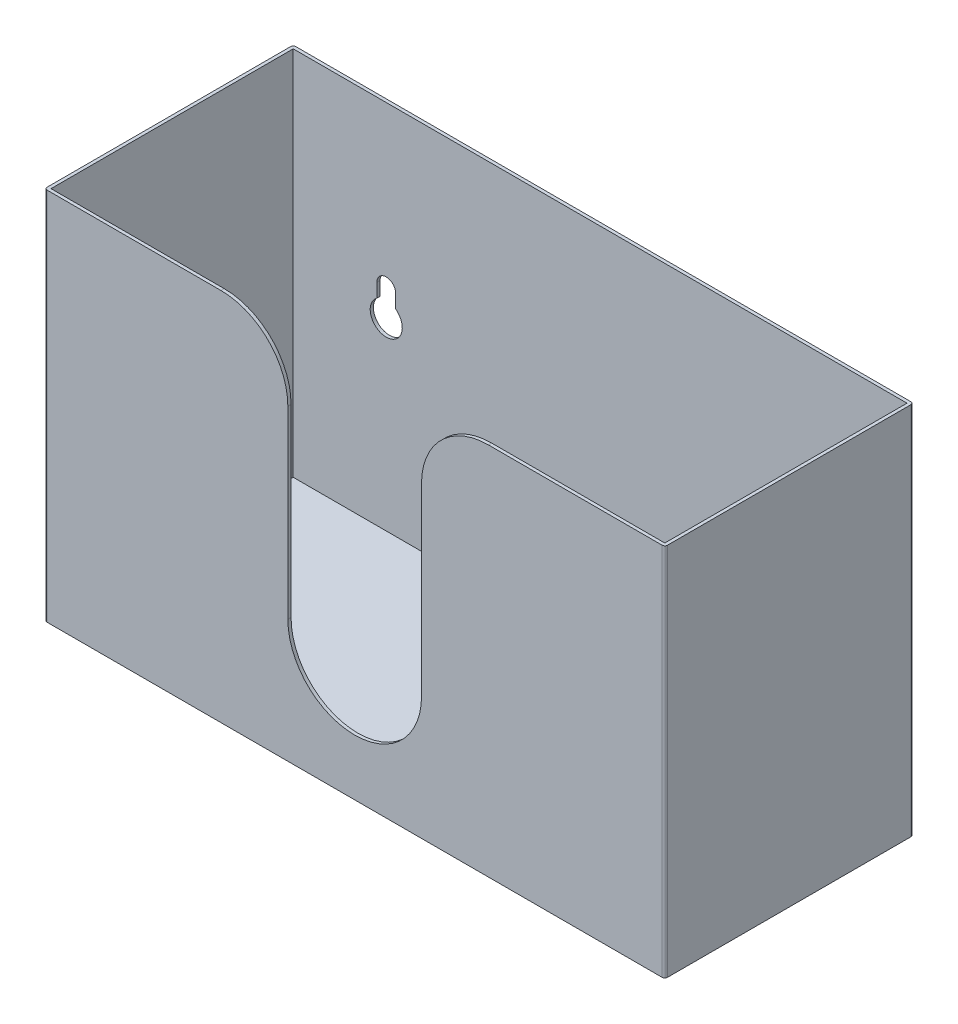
from build123d import *

# Parameters (mm, degrees)
SKETCH1_W           = 232
SKETCH1_H           = 93
BOSS_EXTRUDE1_DEPTH = 140
FILLET1_R           = 1
SHELL1_T            = -1.2
CUT_EXTRUDE1_DEPTH  = 10
FILLET2_R           = 25
CUT_EXTRUDE2_DEPTH  = 10


with BuildPart() as part:
    # Sketch1 → Boss-Extrude1 (new body)
    with BuildSketch(Plane(origin=(0, 0, 0), x_dir=(1, 0, 0), z_dir=(0, 1, 0))):
        Rectangle(SKETCH1_W, SKETCH1_H)
    extrude(amount=BOSS_EXTRUDE1_DEPTH)

    # Fillet1
    fillet1_edges = [part.edges().sort_by_distance(p)[0] for p in [
        (-116, 70, -46.5),
        (116, 70, -46.5),
        (116, 70, 46.5),
        (-116, 70, 46.5),
    ]]
    fillet(fillet1_edges, radius=FILLET1_R)

    # Shell1
    shell1_openings = [part.faces().sort_by_distance(p)[0] for p in [
        (0, 140, 0),
    ]]
    offset(amount=SHELL1_T, openings=shell1_openings, kind=Kind.INTERSECTION)

    # Sketch2 → Cut-Extrude1 (cut)
    with BuildSketch(Plane.XY.offset(46.5)):
        with BuildLine():
            Line((25, 234), (25, 46))
            ThreePointArc((25, 46), (0, 21), (-25, 46))
            Line((-25, 46), (-25, 234))
            ThreePointArc((-25, 234), (0, 259), (25, 234))
        make_face()
    extrude(amount=-CUT_EXTRUDE1_DEPTH, mode=Mode.SUBTRACT)

    # Fillet2
    fillet2_edges = [part.edges().sort_by_distance(p)[0] for p in [
        (25, 140, 45.9),
        (-25, 140, 45.9),
    ]]
    fillet(fillet2_edges, radius=FILLET2_R)

    # Sketch3 → Cut-Extrude2 (cut)
    with BuildSketch(Plane(origin=(0, 0, -46.5), x_dir=(-1, 0, 0), z_dir=(0, 0, -1))):
        with BuildLine():
            ThreePointArc((-76.5, 70), (-80, 66.5), (-83.5, 70))
            Line((-83.5, 70), (-83.5, 74.873397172))
            ThreePointArc((-83.5, 74.873397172), (-82.738612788, 64.661460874), (-74, 70))
            ThreePointArc((-74, 70), (-74.661460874, 72.738612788), (-76.5, 74.873397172))
            Line((-76.5, 74.873397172), (-76.5, 70))
        make_face()
        with BuildLine():
            Line((-83.5, 74.873397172), (-83.5, 70))
            ThreePointArc((-83.5, 70), (-80, 66.5), (-76.5, 70))
            Line((-76.5, 70), (-76.5, 74.873397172))
            ThreePointArc((-76.5, 74.873397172), (-80, 76), (-83.5, 74.873397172))
        make_face()
        with BuildLine():
            ThreePointArc((-76.5, 70), (-80, 66.5), (-83.5, 70))
            Line((-83.5, 70), (-83.5, 74.873397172))
            ThreePointArc((-83.5, 74.873397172), (-82.738612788, 64.661460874), (-74, 70))
            ThreePointArc((-74, 70), (-74.661460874, 72.738612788), (-76.5, 74.873397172))
            Line((-76.5, 74.873397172), (-76.5, 70))
        make_face()
        with BuildLine():
            Line((-83.5, 74.873397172), (-83.5, 70))
            ThreePointArc((-83.5, 70), (-80, 66.5), (-76.5, 70))
            Line((-76.5, 70), (-76.5, 74.873397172))
            ThreePointArc((-76.5, 74.873397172), (-80, 76), (-83.5, 74.873397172))
        make_face()
        with BuildLine():
            Line((-83.5, 80), (-83.5, 74.873397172))
            ThreePointArc((-83.5, 74.873397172), (-80, 76), (-76.5, 74.873397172))
            Line((-76.5, 74.873397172), (-76.5, 80))
            ThreePointArc((-76.5, 80), (-80, 83.5), (-83.5, 80))
        make_face()
        with BuildLine():
            ThreePointArc((76.5, 70), (80, 66.5), (83.5, 70))
            Line((83.5, 70), (83.5, 74.873397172))
            ThreePointArc((83.5, 74.873397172), (80, 76), (76.5, 74.873397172))
            Line((76.5, 74.873397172), (76.5, 70))
        make_face()
        with BuildLine():
            Line((83.5, 74.873397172), (83.5, 70))
            ThreePointArc((83.5, 70), (80, 66.5), (76.5, 70))
            Line((76.5, 70), (76.5, 74.873397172))
            ThreePointArc((76.5, 74.873397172), (77.261387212, 64.661460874), (86, 70))
            ThreePointArc((86, 70), (85.338539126, 72.738612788), (83.5, 74.873397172))
        make_face()
        with BuildLine():
            ThreePointArc((76.5, 70), (80, 66.5), (83.5, 70))
            Line((83.5, 70), (83.5, 74.873397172))
            ThreePointArc((83.5, 74.873397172), (80, 76), (76.5, 74.873397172))
            Line((76.5, 74.873397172), (76.5, 70))
        make_face()
        with BuildLine():
            Line((83.5, 74.873397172), (83.5, 70))
            ThreePointArc((83.5, 70), (80, 66.5), (76.5, 70))
            Line((76.5, 70), (76.5, 74.873397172))
            ThreePointArc((76.5, 74.873397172), (77.261387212, 64.661460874), (86, 70))
            ThreePointArc((86, 70), (85.338539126, 72.738612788), (83.5, 74.873397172))
        make_face()
        with BuildLine():
            ThreePointArc((76.5, 74.873397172), (80, 76), (83.5, 74.873397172))
            Line((83.5, 74.873397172), (83.5, 80))
            ThreePointArc((83.5, 80), (80, 83.5), (76.5, 80))
            Line((76.5, 80), (76.5, 74.873397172))
        make_face()
    extrude(amount=-CUT_EXTRUDE2_DEPTH, mode=Mode.SUBTRACT)


solid = part.part
